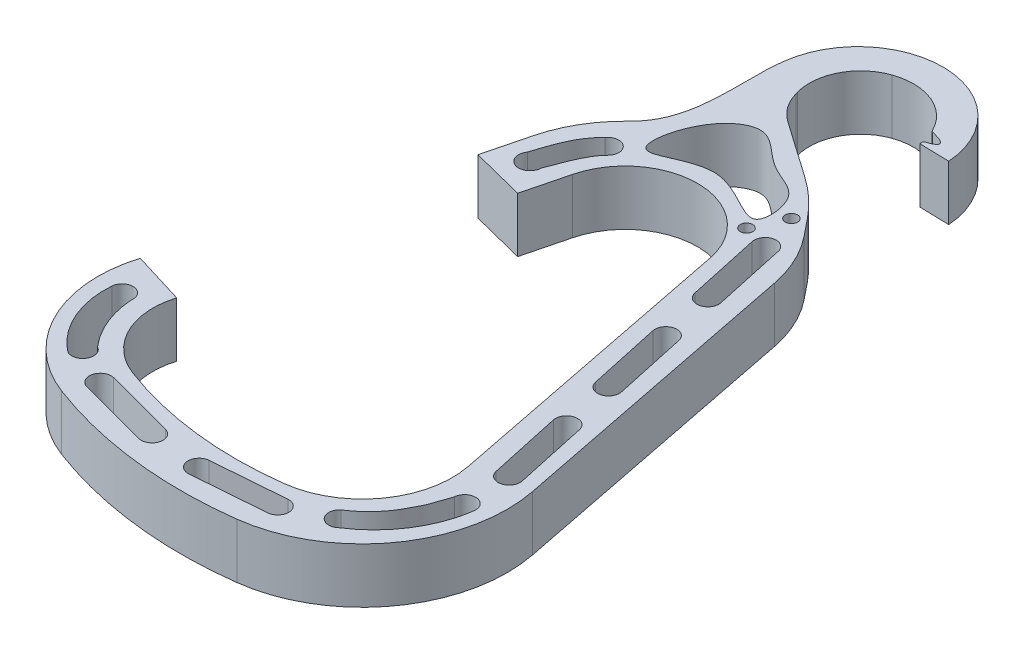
from build123d import *

# Parameters (mm, degrees)
BOSS_EXTRUDE3_DEPTH = 9.525
FILLET2_R           = 8.89
FILLET3_R           = 31.75
CUT_EXTRUDE1_DEPTH  = 102.408595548
FILLET4_R           = 0.254
CUT_EXTRUDE6_DEPTH  = 102.408595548
SKETCH6_R           = 1.0795
CUT_EXTRUDE8_DEPTH  = 102.408595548


with BuildPart() as part:
    # Sketch1 → Boss-Extrude3 (new body)
    with BuildSketch(Plane(origin=(0, 0, 0), x_dir=(1, 0, 0), z_dir=(0, 1, 0))):
        with BuildLine():
            ThreePointArc((-4.322617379, 44.320110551), (8.180986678, 53.786716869), (20.164045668, 43.669254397))
            Line((20.164045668, 43.669254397), (30.499696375, -8.659799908))
            ThreePointArc((30.499696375, -8.659799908), (27.857085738, -20.794632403), (17.18920581, -27.153397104))
            ThreePointArc((17.18920581, -27.153397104), (2.014043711, -27.238556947), (-12.728713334, -23.640792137))
            ThreePointArc((-12.728713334, -23.640792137), (-19.396765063, -17.572663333), (-20.112713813, -8.585310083))
            Line((-20.112713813, -8.585310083), (-29.220717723, -5.797857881))
            ThreePointArc((-29.220717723, -5.797857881), (-27.948592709, -21.766929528), (-16.100544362, -32.549011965))
            ThreePointArc((-16.100544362, -32.549011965), (0.90336089, -36.698578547), (18.40599067, -36.600357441))
            ThreePointArc((18.40599067, -36.600357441), (35.587921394, -26.358785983), (39.844170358, -6.814147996))
            Line((39.844170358, -6.814147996), (29.508519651, 45.514906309))
            ThreePointArc((29.508519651, 45.514906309), (27.857243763, 50.570075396), (25.045152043, 55.083786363))
            Line((25.045152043, 55.083786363), (19.917614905, 61.452000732))
            Line((19.917614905, 61.452000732), (3.807023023, 72.716190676))
            Line((3.807023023, 72.716190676), (2.058216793, 78.87954149))
            ThreePointArc((2.058216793, 78.87954149), (11.56717066, 87.479140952), (21.207917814, 79.027554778))
            Line((21.207917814, 79.027554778), (26.323751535, 78.891575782))
            ThreePointArc((26.323751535, 78.891575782), (12.032788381, 92.554231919), (-2.963790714, 79.670039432))
            add(Edge.make_bspline(
                [(-7.400914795, 57.205186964), (-1.495075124, 62.844628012), (-3.980914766, 73.157564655), (-2.963790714, 79.670039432)],
                knots=[0, 0, 0, 0, 1, 1, 1, 1], degree=3))
            ThreePointArc((-7.400914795, 57.205186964), (-11.221865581, 52.366304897), (-13.555851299, 46.659558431))
            Line((-13.555851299, 46.659558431), (-15.486284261, 39.040607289))
            Line((-15.486284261, 39.040607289), (-6.253050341, 36.701159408))
            Line((-6.253050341, 36.701159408), (-4.322617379, 44.320110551))
        make_face()
    extrude(amount=BOSS_EXTRUDE3_DEPTH)

    # Fillet2
    fillet2_edges = [part.edges().sort_by_distance(p)[0] for p in [
        (2.058216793, 4.7625, -78.87954149),
        (3.807023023, 4.7625, -72.716190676),
    ]]
    fillet(fillet2_edges, radius=FILLET2_R)

    # Fillet3
    fillet3_edges = [part.edges().sort_by_distance(p)[0] for p in [
        (19.917614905, 4.7625, -61.452000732),
    ]]
    fillet(fillet3_edges, radius=FILLET3_R)

    # Sketch2 → Cut-Extrude1 (cut, through all)
    with BuildSketch(Plane(origin=(0, 9.525, 0), x_dir=(1, 0, 0), z_dir=(0, 1, 0))):
        with BuildLine():
            add(Edge.make_bspline(
                [(20.361072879, 81.950203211), (25.079664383, 80.807836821), (21.11120263, 79.643051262)],
                knots=[0, 0, 0, 1, 1, 1], degree=2))
            ThreePointArc((20.361072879, 81.950203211), (20.809007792, 80.820319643), (21.11120263, 79.643051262))
        make_face()
    extrude(amount=-CUT_EXTRUDE1_DEPTH, mode=Mode.SUBTRACT)

    # Fillet4
    fillet4_edges = [part.edges().sort_by_distance(p)[0] for p in [
        (20.361072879, 4.7625, -81.950203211),
        (21.11120263, 4.7625, -79.643051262),
    ]]
    fillet(fillet4_edges, radius=FILLET4_R)

    # Sketch5 → Cut-Extrude6 (cut, through all)
    with BuildSketch(Plane(origin=(0, 9.525, 0), x_dir=(1, 0, 0), z_dir=(0, 1, 0))):
        with BuildLine():
            add(Edge.make_bspline(
                [(-1.798981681, 54.489990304), (-0.353217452, 53.460318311), (8.296052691, 61.085612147), (19.737500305, 49.197085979), (18.670778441, 61.170908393), (11.471468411, 62.150707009), (6.276937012, 69.147298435), (-1.516196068, 63.949039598), (-3.126632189, 55.435541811), (-1.798981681, 54.489990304)],
                knots=[0, 0, 0, 0, 0.175121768, 0.368271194, 0.466833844, 0.586943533, 0.718963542, 0.839185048, 1, 1, 1, 1], degree=3))
        make_face()
        with BuildLine():
            Line((25.068444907, 50.578550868), (27.823471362, 37.878550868))
            ThreePointArc((27.823471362, 37.878550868), (26.365633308, 35.61299173), (24.10007417, 37.070829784))
            Line((24.10007417, 37.070829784), (21.345047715, 49.770829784))
            ThreePointArc((21.345047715, 49.770829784), (22.802885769, 52.036388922), (25.068444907, 50.578550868))
        make_face()
        with BuildLine():
            Line((29.842774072, 28.570057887), (32.597800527, 15.870057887))
            ThreePointArc((32.597800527, 15.870057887), (31.139962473, 13.604498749), (28.874403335, 15.062336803))
            Line((28.874403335, 15.062336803), (26.11937688, 27.762336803))
            ThreePointArc((26.11937688, 27.762336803), (27.577214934, 30.027895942), (29.842774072, 28.570057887))
        make_face()
        with BuildLine():
            Line((34.617103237, 6.561564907), (37.372129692, -6.138435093))
            ThreePointArc((37.372129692, -6.138435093), (35.914291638, -8.403994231), (33.6487325, -6.946156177))
            Line((33.6487325, -6.946156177), (30.893706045, 5.753843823))
            ThreePointArc((30.893706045, 5.753843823), (32.351544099, 8.019402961), (34.617103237, 6.561564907))
        make_face()
        with BuildLine():
            Line((20.068599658, -32.986564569), (7.407255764, -33.976701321))
            ThreePointArc((7.407255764, -33.976701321), (5.359533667, -32.22602025), (7.110214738, -30.178298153))
            Line((7.110214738, -30.178298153), (19.771558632, -29.188161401))
            ThreePointArc((19.771558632, -29.188161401), (21.819280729, -30.938842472), (20.068599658, -32.986564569))
        make_face()
        with BuildLine():
            Line((-2.290024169, -32.996047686), (-14.560860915, -29.7224311))
            ThreePointArc((-14.560860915, -29.7224311), (-15.910443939, -27.3907631), (-13.578775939, -26.041180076))
            Line((-13.578775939, -26.041180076), (-1.307939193, -29.314796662))
            ThreePointArc((-1.307939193, -29.314796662), (0.041643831, -31.646464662), (-2.290024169, -32.996047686))
        make_face()
        with BuildLine():
            ThreePointArc((-11.600112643, 43.711579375), (-10.579916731, 40.664062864), (-7.97341399, 42.544036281))
            add(Edge.make_bspline(
                [(-7.97341399, 42.544036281), (-6.844021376, 45.293857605), (-6.108789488, 48.27068629), (-3.927816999, 50.456051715)],
                knots=[0, 0, 0, 0, 1, 1, 1, 1], degree=3))
            ThreePointArc((-3.927816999, 50.456051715), (-4.381700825, 53.111619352), (-7.037268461, 52.657735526))
            add(Edge.make_bspline(
                [(-11.600112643, 43.711579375), (-10.574673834, 46.920122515), (-9.566175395, 50.287369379), (-7.037268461, 52.657735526)],
                knots=[0, 0, 0, 0, 1, 1, 1, 1], degree=3))
        make_face()
        with BuildLine():
            ThreePointArc((37.670369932, -14.619799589), (35.877724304, -12.608712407), (33.866637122, -14.401358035))
            add(Edge.make_bspline(
                [(25.972941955, -26.195777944), (30.260328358, -23.451540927), (32.097929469, -18.483102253), (32.607087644, -18.296392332), (33.866637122, -14.401358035)],
                knots=[0, 0, 0, 0, 0.68108357, 1, 1, 1, 1], degree=3))
            ThreePointArc((25.972941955, -26.195777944), (25.808082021, -28.9224774), (28.538269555, -29.012725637))
            add(Edge.make_bspline(
                [(37.670369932, -14.619799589), (36.97959598, -20.420296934), (33.454771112, -25.883649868), (28.538269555, -29.012725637)],
                knots=[0, 0, 0, 0, 1, 1, 1, 1], degree=3))
        make_face()
        with BuildLine():
            ThreePointArc((-21.352587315, -26.195777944), (-18.792761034, -25.355933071), (-19.632605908, -22.79610679))
            add(Edge.make_bspline(
                [(-23.707711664, -12.706481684), (-23.548985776, -16.403118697), (-22.036192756, -19.989815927), (-19.632605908, -22.79610679)],
                knots=[0, 0, 0, 0, 1, 1, 1, 1], degree=3))
            ThreePointArc((-23.707711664, -12.706481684), (-25.456874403, -10.657462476), (-27.505893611, -12.406625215))
            add(Edge.make_bspline(
                [(-27.505893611, -12.406625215), (-27.949032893, -17.684288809), (-25.556098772, -23.032580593), (-21.352587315, -26.195777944)],
                knots=[0, 0, 0, 0, 1, 1, 1, 1], degree=3))
        make_face()
    extrude(amount=-CUT_EXTRUDE6_DEPTH, mode=Mode.SUBTRACT)

    # Sketch6 → Cut-Extrude8 (cut, through all)
    with BuildSketch(Plane(origin=(0, 9.525, 0), x_dir=(1, 0, 0), z_dir=(0, 1, 0))):
        with Locations(Location((21.289416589, 56.647668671, 0), (0, 0, 270))):
            Circle(SKETCH6_R)
        with Locations(Location((18.820690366, 51.312034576, 0), (0, 0, 270))):
            Circle(SKETCH6_R)
    extrude(amount=-CUT_EXTRUDE8_DEPTH, mode=Mode.SUBTRACT)


solid = part.part
